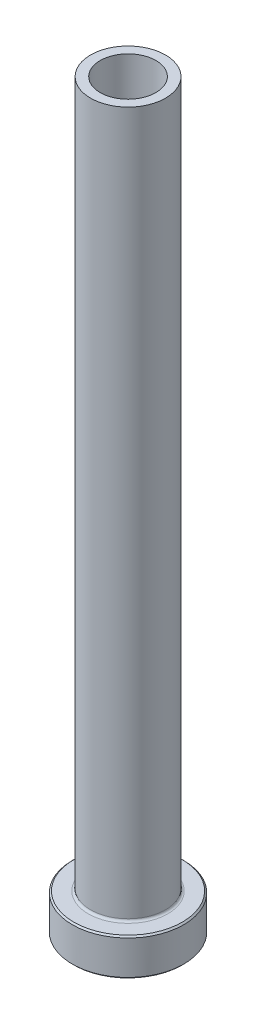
ISO-10303-21;
HEADER;
FILE_DESCRIPTION(('STEP AP214'),'2;1');
FILE_NAME('part.step','',(''),(''),'','','');
FILE_SCHEMA(('AUTOMOTIVE_DESIGN { 1 0 10303 214 1 1 1 1 }'));
ENDSEC;
DATA;
#1=APPLICATION_CONTEXT('core data for automotive mechanical design processes');
#2=APPLICATION_PROTOCOL_DEFINITION('international standard','automotive_design',2000,#1);
#3=PRODUCT_CONTEXT('',#1,'mechanical');
#4=PRODUCT('Part','Part','',(#3));
#5=PRODUCT_RELATED_PRODUCT_CATEGORY('part','',(#4));
#6=PRODUCT_DEFINITION_FORMATION('','',#4);
#7=PRODUCT_DEFINITION_CONTEXT('part definition',#1,'design');
#8=PRODUCT_DEFINITION('design','',#6,#7);
#9=PRODUCT_DEFINITION_SHAPE('','',#8);
#10=(LENGTH_UNIT() NAMED_UNIT(*) SI_UNIT(.MILLI.,.METRE.));
#11=(NAMED_UNIT(*) PLANE_ANGLE_UNIT() SI_UNIT($,.RADIAN.));
#12=(NAMED_UNIT(*) SI_UNIT($,.STERADIAN.) SOLID_ANGLE_UNIT());
#13=UNCERTAINTY_MEASURE_WITH_UNIT(LENGTH_MEASURE(1.E-05),#10,'distance_accuracy_value','');
#14=(GEOMETRIC_REPRESENTATION_CONTEXT(3) GLOBAL_UNCERTAINTY_ASSIGNED_CONTEXT((#13)) GLOBAL_UNIT_ASSIGNED_CONTEXT((#10,
#11,#12)) REPRESENTATION_CONTEXT('',''));
#15=CARTESIAN_POINT('',(0.,0.,0.));
#16=DIRECTION('',(0.,0.,1.));
#17=DIRECTION('',(1.,0.,0.));
#18=AXIS2_PLACEMENT_3D('',#15,#16,#17);
#19=CARTESIAN_POINT('',(0.,0.,0.));
#20=DIRECTION('',(0.,-1.,0.));
#21=DIRECTION('',(0.,0.,-1.));
#22=AXIS2_PLACEMENT_3D('',#19,#20,#21);
#23=PLANE('',#22);
#24=CARTESIAN_POINT('',(0.,0.,0.));
#25=DIRECTION('',(0.,-1.,0.));
#26=DIRECTION('',(0.,0.,-1.));
#27=AXIS2_PLACEMENT_3D('',#24,#25,#26);
#28=CIRCLE('',#27,9.271);
#29=CARTESIAN_POINT('',(0.,0.,-9.271));
#30=VERTEX_POINT('',#29);
#31=EDGE_CURVE('E44',#30,#30,#28,.T.);
#32=ORIENTED_EDGE('',*,*,#31,.T.);
#33=EDGE_LOOP('',(#32));
#34=FACE_BOUND('',#33,.T.);
#35=CARTESIAN_POINT('',(0.,0.,0.));
#36=DIRECTION('',(0.,-1.,0.));
#37=DIRECTION('',(0.,0.,-1.));
#38=AXIS2_PLACEMENT_3D('',#35,#36,#37);
#39=CIRCLE('',#38,5.34987500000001);
#40=CARTESIAN_POINT('',(0.,0.,-5.34987500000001));
#41=VERTEX_POINT('',#40);
#42=EDGE_CURVE('E58',#41,#41,#39,.T.);
#43=ORIENTED_EDGE('',*,*,#42,.F.);
#44=EDGE_LOOP('',(#43));
#45=FACE_BOUND('',#44,.T.);
#46=ADVANCED_FACE('F29',(#34,#45),#23,.T.);
#47=CARTESIAN_POINT('',(0.,0.,0.));
#48=DIRECTION('',(0.,-1.,0.));
#49=DIRECTION('',(0.,0.,-1.));
#50=AXIS2_PLACEMENT_3D('',#47,#48,#49);
#51=CYLINDRICAL_SURFACE('',#50,9.525);
#52=CARTESIAN_POINT('',(0.,0.254000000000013,0.));
#53=DIRECTION('',(0.,-1.,0.));
#54=DIRECTION('',(0.,0.,-1.));
#55=AXIS2_PLACEMENT_3D('',#52,#53,#54);
#56=CIRCLE('',#55,9.525);
#57=CARTESIAN_POINT('',(0.,0.254000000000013,-9.525));
#58=VERTEX_POINT('',#57);
#59=EDGE_CURVE('E36',#58,#58,#56,.F.);
#60=ORIENTED_EDGE('',*,*,#59,.T.);
#61=EDGE_LOOP('',(#60));
#62=FACE_BOUND('',#61,.T.);
#63=CARTESIAN_POINT('',(0.,6.09599999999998,0.));
#64=DIRECTION('',(0.,1.,0.));
#65=DIRECTION('',(0.,0.,1.));
#66=AXIS2_PLACEMENT_3D('',#63,#64,#65);
#67=CIRCLE('',#66,9.525);
#68=CARTESIAN_POINT('',(0.,6.09599999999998,9.525));
#69=VERTEX_POINT('',#68);
#70=EDGE_CURVE('E40',#69,#69,#67,.F.);
#71=ORIENTED_EDGE('',*,*,#70,.T.);
#72=EDGE_LOOP('',(#71));
#73=FACE_BOUND('',#72,.T.);
#74=ADVANCED_FACE('F103',(#62,#73),#51,.T.);
#75=CARTESIAN_POINT('',(9.525,6.35,0.));
#76=DIRECTION('',(0.,1.,0.));
#77=DIRECTION('',(0.,0.,1.));
#78=AXIS2_PLACEMENT_3D('',#75,#76,#77);
#79=PLANE('',#78);
#80=CARTESIAN_POINT('',(0.,6.35,0.));
#81=DIRECTION('',(0.,1.,0.));
#82=DIRECTION('',(0.,0.,1.));
#83=AXIS2_PLACEMENT_3D('',#80,#81,#82);
#84=CIRCLE('',#83,9.27099999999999);
#85=CARTESIAN_POINT('',(0.,6.35,9.27099999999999));
#86=VERTEX_POINT('',#85);
#87=EDGE_CURVE('E10',#86,#86,#84,.T.);
#88=ORIENTED_EDGE('',*,*,#87,.T.);
#89=EDGE_LOOP('',(#88));
#90=FACE_BOUND('',#89,.T.);
#91=CARTESIAN_POINT('',(0.,6.35,0.));
#92=DIRECTION('',(0.,-1.,0.));
#93=DIRECTION('',(0.,0.,-1.));
#94=AXIS2_PLACEMENT_3D('',#91,#92,#93);
#95=CIRCLE('',#94,6.804025);
#96=CARTESIAN_POINT('',(0.,6.35,-6.804025));
#97=VERTEX_POINT('',#96);
#98=EDGE_CURVE('E49',#97,#97,#95,.T.);
#99=ORIENTED_EDGE('',*,*,#98,.T.);
#100=EDGE_LOOP('',(#99));
#101=FACE_BOUND('',#100,.T.);
#102=ADVANCED_FACE('F109',(#90,#101),#79,.T.);
#103=CARTESIAN_POINT('',(0.,6.746875,0.));
#104=DIRECTION('',(0.,-1.,0.));
#105=DIRECTION('',(0.,0.,-1.));
#106=AXIS2_PLACEMENT_3D('',#103,#104,#105);
#107=TOROIDAL_SURFACE('',#106,6.804025,0.396874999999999);
#108=CARTESIAN_POINT('',(0.,6.746875,0.));
#109=DIRECTION('',(0.,-1.,0.));
#110=DIRECTION('',(0.,0.,-1.));
#111=AXIS2_PLACEMENT_3D('',#108,#109,#110);
#112=CIRCLE('',#111,6.40715);
#113=CARTESIAN_POINT('',(0.,6.746875,-6.40715));
#114=VERTEX_POINT('',#113);
#115=EDGE_CURVE('E52',#114,#114,#112,.T.);
#116=ORIENTED_EDGE('',*,*,#115,.T.);
#117=EDGE_LOOP('',(#116));
#118=FACE_BOUND('',#117,.T.);
#119=ORIENTED_EDGE('',*,*,#98,.F.);
#120=EDGE_LOOP('',(#119));
#121=FACE_BOUND('',#120,.T.);
#122=ADVANCED_FACE('F139',(#118,#121),#107,.F.);
#123=CARTESIAN_POINT('',(0.,0.,0.));
#124=DIRECTION('',(0.,-1.,0.));
#125=DIRECTION('',(0.,0.,-1.));
#126=AXIS2_PLACEMENT_3D('',#123,#124,#125);
#127=CYLINDRICAL_SURFACE('',#126,6.40715);
#128=CARTESIAN_POINT('',(0.,127.,0.));
#129=DIRECTION('',(0.,-1.,0.));
#130=DIRECTION('',(0.,0.,-1.));
#131=AXIS2_PLACEMENT_3D('',#128,#129,#130);
#132=CIRCLE('',#131,6.40715);
#133=CARTESIAN_POINT('',(0.,127.,-6.40715));
#134=VERTEX_POINT('',#133);
#135=EDGE_CURVE('E55',#134,#134,#132,.T.);
#136=ORIENTED_EDGE('',*,*,#135,.T.);
#137=EDGE_LOOP('',(#136));
#138=FACE_BOUND('',#137,.T.);
#139=ORIENTED_EDGE('',*,*,#115,.F.);
#140=EDGE_LOOP('',(#139));
#141=FACE_BOUND('',#140,.T.);
#142=ADVANCED_FACE('F182',(#138,#141),#127,.T.);
#143=CARTESIAN_POINT('',(6.40715,127.,0.));
#144=DIRECTION('',(0.,1.,0.));
#145=DIRECTION('',(0.,0.,1.));
#146=AXIS2_PLACEMENT_3D('',#143,#144,#145);
#147=PLANE('',#146);
#148=CARTESIAN_POINT('',(0.,127.,0.));
#149=DIRECTION('',(0.,-1.,0.));
#150=DIRECTION('',(0.,0.,-1.));
#151=AXIS2_PLACEMENT_3D('',#148,#149,#150);
#152=CIRCLE('',#151,4.7625);
#153=CARTESIAN_POINT('',(0.,127.,-4.7625));
#154=VERTEX_POINT('',#153);
#155=EDGE_CURVE('E70',#154,#154,#152,.T.);
#156=ORIENTED_EDGE('',*,*,#155,.T.);
#157=EDGE_LOOP('',(#156));
#158=FACE_BOUND('',#157,.T.);
#159=ORIENTED_EDGE('',*,*,#135,.F.);
#160=EDGE_LOOP('',(#159));
#161=FACE_BOUND('',#160,.T.);
#162=ADVANCED_FACE('F74',(#158,#161),#147,.T.);
#163=CARTESIAN_POINT('',(0.,0.,0.));
#164=DIRECTION('',(0.,-1.,0.));
#165=DIRECTION('',(0.,0.,-1.));
#166=AXIS2_PLACEMENT_3D('',#163,#164,#165);
#167=CONICAL_SURFACE('',#166,5.34987500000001,0.785398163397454);
#168=CARTESIAN_POINT('',(0.,0.396875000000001,0.));
#169=DIRECTION('',(0.,-1.,0.));
#170=DIRECTION('',(0.,0.,-1.));
#171=AXIS2_PLACEMENT_3D('',#168,#169,#170);
#172=CIRCLE('',#171,4.953);
#173=CARTESIAN_POINT('',(0.,0.396875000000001,-4.953));
#174=VERTEX_POINT('',#173);
#175=EDGE_CURVE('E61',#174,#174,#172,.T.);
#176=ORIENTED_EDGE('',*,*,#175,.F.);
#177=EDGE_LOOP('',(#176));
#178=FACE_BOUND('',#177,.T.);
#179=ORIENTED_EDGE('',*,*,#42,.T.);
#180=EDGE_LOOP('',(#179));
#181=FACE_BOUND('',#180,.T.);
#182=ADVANCED_FACE('F93',(#178,#181),#167,.F.);
#183=CARTESIAN_POINT('',(0.,0.,0.));
#184=DIRECTION('',(0.,-1.,0.));
#185=DIRECTION('',(0.,0.,-1.));
#186=AXIS2_PLACEMENT_3D('',#183,#184,#185);
#187=CYLINDRICAL_SURFACE('',#186,4.953);
#188=CARTESIAN_POINT('',(0.,52.5145,0.));
#189=DIRECTION('',(0.,-1.,0.));
#190=DIRECTION('',(0.,0.,-1.));
#191=AXIS2_PLACEMENT_3D('',#188,#189,#190);
#192=CIRCLE('',#191,4.953);
#193=CARTESIAN_POINT('',(0.,52.5145,-4.953));
#194=VERTEX_POINT('',#193);
#195=EDGE_CURVE('E64',#194,#194,#192,.T.);
#196=ORIENTED_EDGE('',*,*,#195,.F.);
#197=EDGE_LOOP('',(#196));
#198=FACE_BOUND('',#197,.T.);
#199=ORIENTED_EDGE('',*,*,#175,.T.);
#200=EDGE_LOOP('',(#199));
#201=FACE_BOUND('',#200,.T.);
#202=ADVANCED_FACE('F87',(#198,#201),#187,.F.);
#203=CARTESIAN_POINT('',(0.,52.5145,0.));
#204=DIRECTION('',(0.,-1.,0.));
#205=DIRECTION('',(0.,0.,-1.));
#206=AXIS2_PLACEMENT_3D('',#203,#204,#205);
#207=CONICAL_SURFACE('',#206,4.953,0.0133325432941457);
#208=CARTESIAN_POINT('',(0.,66.802,0.));
#209=DIRECTION('',(0.,-1.,0.));
#210=DIRECTION('',(0.,0.,-1.));
#211=AXIS2_PLACEMENT_3D('',#208,#209,#210);
#212=CIRCLE('',#211,4.7625);
#213=CARTESIAN_POINT('',(0.,66.802,-4.7625));
#214=VERTEX_POINT('',#213);
#215=EDGE_CURVE('E67',#214,#214,#212,.T.);
#216=ORIENTED_EDGE('',*,*,#215,.F.);
#217=EDGE_LOOP('',(#216));
#218=FACE_BOUND('',#217,.T.);
#219=ORIENTED_EDGE('',*,*,#195,.T.);
#220=EDGE_LOOP('',(#219));
#221=FACE_BOUND('',#220,.T.);
#222=ADVANCED_FACE('F81',(#218,#221),#207,.F.);
#223=CARTESIAN_POINT('',(0.,0.,0.));
#224=DIRECTION('',(0.,-1.,0.));
#225=DIRECTION('',(0.,0.,-1.));
#226=AXIS2_PLACEMENT_3D('',#223,#224,#225);
#227=CYLINDRICAL_SURFACE('',#226,4.7625);
#228=ORIENTED_EDGE('',*,*,#155,.F.);
#229=EDGE_LOOP('',(#228));
#230=FACE_BOUND('',#229,.T.);
#231=ORIENTED_EDGE('',*,*,#215,.T.);
#232=EDGE_LOOP('',(#231));
#233=FACE_BOUND('',#232,.T.);
#234=ADVANCED_FACE('F77',(#230,#233),#227,.F.);
#235=CARTESIAN_POINT('',(0.,0.,0.));
#236=DIRECTION('',(0.,1.,0.));
#237=DIRECTION('',(0.,0.,1.));
#238=AXIS2_PLACEMENT_3D('',#235,#236,#237);
#239=CONICAL_SURFACE('',#238,9.271,0.785398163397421);
#240=ORIENTED_EDGE('',*,*,#59,.F.);
#241=EDGE_LOOP('',(#240));
#242=FACE_BOUND('',#241,.T.);
#243=ORIENTED_EDGE('',*,*,#31,.F.);
#244=EDGE_LOOP('',(#243));
#245=FACE_BOUND('',#244,.T.);
#246=ADVANCED_FACE('F80',(#242,#245),#239,.T.);
#247=CARTESIAN_POINT('',(0.,6.09599999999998,0.));
#248=DIRECTION('',(0.,-1.,0.));
#249=DIRECTION('',(0.,0.,-1.));
#250=AXIS2_PLACEMENT_3D('',#247,#248,#249);
#251=CONICAL_SURFACE('',#250,9.525,0.785398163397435);
#252=ORIENTED_EDGE('',*,*,#87,.F.);
#253=EDGE_LOOP('',(#252));
#254=FACE_BOUND('',#253,.T.);
#255=ORIENTED_EDGE('',*,*,#70,.F.);
#256=EDGE_LOOP('',(#255));
#257=FACE_BOUND('',#256,.T.);
#258=ADVANCED_FACE('F31',(#254,#257),#251,.T.);
#259=CLOSED_SHELL('',(#46,#74,#102,#122,#142,#162,#182,#202,#222,#234,#246,#258));
#260=MANIFOLD_SOLID_BREP('B2',#259);
#261=ADVANCED_BREP_SHAPE_REPRESENTATION('',(#18,#260),#14);
#262=SHAPE_DEFINITION_REPRESENTATION(#9,#261);
ENDSEC;
END-ISO-10303-21;
